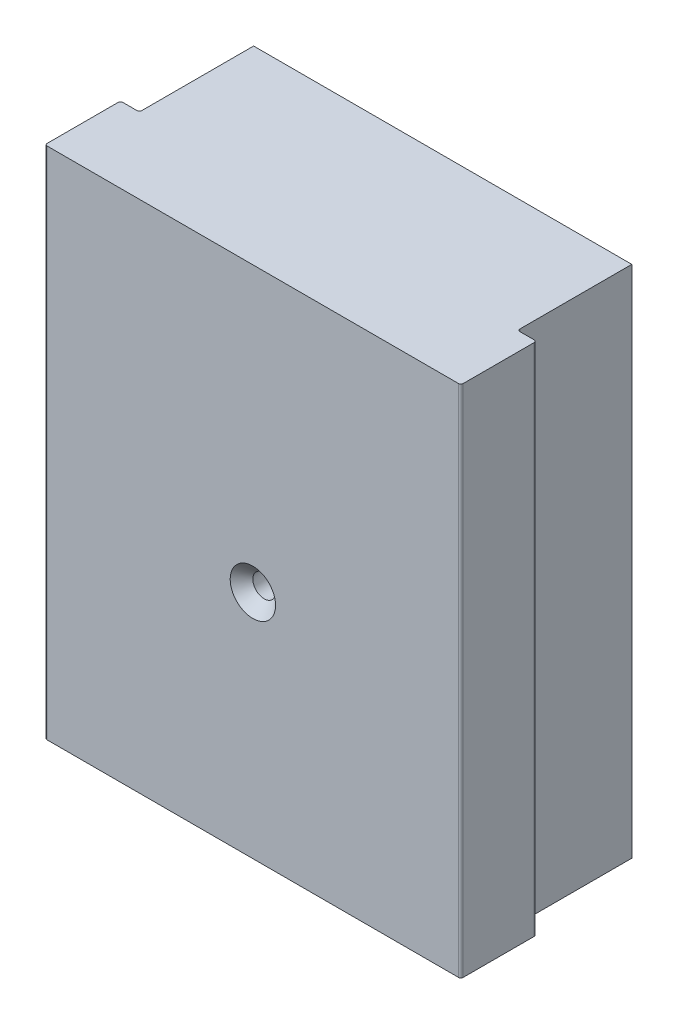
ISO-10303-21;
HEADER;
FILE_DESCRIPTION(('STEP AP214'),'2;1');
FILE_NAME('part.step','',(''),(''),'','','');
FILE_SCHEMA(('AUTOMOTIVE_DESIGN { 1 0 10303 214 1 1 1 1 }'));
ENDSEC;
DATA;
#1=APPLICATION_CONTEXT('core data for automotive mechanical design processes');
#2=APPLICATION_PROTOCOL_DEFINITION('international standard','automotive_design',2000,#1);
#3=PRODUCT_CONTEXT('',#1,'mechanical');
#4=PRODUCT('Part','Part','',(#3));
#5=PRODUCT_RELATED_PRODUCT_CATEGORY('part','',(#4));
#6=PRODUCT_DEFINITION_FORMATION('','',#4);
#7=PRODUCT_DEFINITION_CONTEXT('part definition',#1,'design');
#8=PRODUCT_DEFINITION('design','',#6,#7);
#9=PRODUCT_DEFINITION_SHAPE('','',#8);
#10=(LENGTH_UNIT() NAMED_UNIT(*) SI_UNIT(.MILLI.,.METRE.));
#11=(NAMED_UNIT(*) PLANE_ANGLE_UNIT() SI_UNIT($,.RADIAN.));
#12=(NAMED_UNIT(*) SI_UNIT($,.STERADIAN.) SOLID_ANGLE_UNIT());
#13=UNCERTAINTY_MEASURE_WITH_UNIT(LENGTH_MEASURE(1.E-05),#10,'distance_accuracy_value','');
#14=(GEOMETRIC_REPRESENTATION_CONTEXT(3) GLOBAL_UNCERTAINTY_ASSIGNED_CONTEXT((#13)) GLOBAL_UNIT_ASSIGNED_CONTEXT((#10,
#11,#12)) REPRESENTATION_CONTEXT('',''));
#15=CARTESIAN_POINT('',(0.,0.,0.));
#16=DIRECTION('',(0.,0.,1.));
#17=DIRECTION('',(1.,0.,0.));
#18=AXIS2_PLACEMENT_3D('',#15,#16,#17);
#19=CARTESIAN_POINT('',(27.5,68.,-10.));
#20=DIRECTION('',(-1.,0.,0.));
#21=DIRECTION('',(0.,0.,1.));
#22=AXIS2_PLACEMENT_3D('',#19,#20,#21);
#23=PLANE('',#22);
#24=DIRECTION('',(0.,0.,-1.));
#25=VECTOR('',#24,1.);
#26=CARTESIAN_POINT('',(27.5,68.,-10.));
#27=LINE('',#26,#25);
#28=CARTESIAN_POINT('',(27.5,68.,-0.3));
#29=VERTEX_POINT('',#28);
#30=CARTESIAN_POINT('',(27.5,68.,-9.7));
#31=VERTEX_POINT('',#30);
#32=EDGE_CURVE('E195',#29,#31,#27,.T.);
#33=ORIENTED_EDGE('',*,*,#32,.F.);
#34=DIRECTION('',(0.,-1.,0.));
#35=VECTOR('',#34,1.);
#36=CARTESIAN_POINT('',(27.5,68.,-0.3));
#37=LINE('',#36,#35);
#38=CARTESIAN_POINT('',(27.5,0.,-0.3));
#39=VERTEX_POINT('',#38);
#40=EDGE_CURVE('E230',#29,#39,#37,.T.);
#41=ORIENTED_EDGE('',*,*,#40,.T.);
#42=DIRECTION('',(0.,0.,-1.));
#43=VECTOR('',#42,1.);
#44=CARTESIAN_POINT('',(27.5,0.,-10.));
#45=LINE('',#44,#43);
#46=CARTESIAN_POINT('',(27.5,0.,-9.7));
#47=VERTEX_POINT('',#46);
#48=EDGE_CURVE('E174',#39,#47,#45,.T.);
#49=ORIENTED_EDGE('',*,*,#48,.T.);
#50=DIRECTION('',(0.,-1.,0.));
#51=VECTOR('',#50,1.);
#52=CARTESIAN_POINT('',(27.5,68.,-9.7));
#53=LINE('',#52,#51);
#54=EDGE_CURVE('E228',#47,#31,#53,.F.);
#55=ORIENTED_EDGE('',*,*,#54,.T.);
#56=EDGE_LOOP('',(#33,#41,#49,#55));
#57=FACE_BOUND('',#56,.T.);
#58=ADVANCED_FACE('F34',(#57),#23,.F.);
#59=CARTESIAN_POINT('',(27.5,68.,-10.));
#60=DIRECTION('',(0.,0.,1.));
#61=DIRECTION('',(1.,0.,0.));
#62=AXIS2_PLACEMENT_3D('',#59,#60,#61);
#63=PLANE('',#62);
#64=DIRECTION('',(-1.,0.,0.));
#65=VECTOR('',#64,1.);
#66=CARTESIAN_POINT('',(27.5,68.,-10.));
#67=LINE('',#66,#65);
#68=CARTESIAN_POINT('',(27.2,68.,-10.));
#69=VERTEX_POINT('',#68);
#70=CARTESIAN_POINT('',(25.3,68.,-10.));
#71=VERTEX_POINT('',#70);
#72=EDGE_CURVE('E147',#69,#71,#67,.T.);
#73=ORIENTED_EDGE('',*,*,#72,.F.);
#74=DIRECTION('',(0.,-1.,0.));
#75=VECTOR('',#74,1.);
#76=CARTESIAN_POINT('',(27.2,68.,-10.));
#77=LINE('',#76,#75);
#78=CARTESIAN_POINT('',(27.2,0.,-10.));
#79=VERTEX_POINT('',#78);
#80=EDGE_CURVE('E235',#69,#79,#77,.T.);
#81=ORIENTED_EDGE('',*,*,#80,.T.);
#82=DIRECTION('',(-1.,0.,0.));
#83=VECTOR('',#82,1.);
#84=CARTESIAN_POINT('',(27.5,0.,-10.));
#85=LINE('',#84,#83);
#86=CARTESIAN_POINT('',(25.3,0.,-10.));
#87=VERTEX_POINT('',#86);
#88=EDGE_CURVE('E177',#79,#87,#85,.T.);
#89=ORIENTED_EDGE('',*,*,#88,.T.);
#90=DIRECTION('',(0.,-1.,0.));
#91=VECTOR('',#90,1.);
#92=CARTESIAN_POINT('',(25.3,68.,-10.));
#93=LINE('',#92,#91);
#94=EDGE_CURVE('E233',#87,#71,#93,.F.);
#95=ORIENTED_EDGE('',*,*,#94,.T.);
#96=EDGE_LOOP('',(#73,#81,#89,#95));
#97=FACE_BOUND('',#96,.T.);
#98=ADVANCED_FACE('F251',(#97),#63,.F.);
#99=CARTESIAN_POINT('',(25.,68.,-25.1));
#100=DIRECTION('',(-1.,0.,0.));
#101=DIRECTION('',(0.,0.,1.));
#102=AXIS2_PLACEMENT_3D('',#99,#100,#101);
#103=PLANE('',#102);
#104=DIRECTION('',(0.,0.,-1.));
#105=VECTOR('',#104,1.);
#106=CARTESIAN_POINT('',(25.,68.,-25.1));
#107=LINE('',#106,#105);
#108=CARTESIAN_POINT('',(25.,68.,-10.3));
#109=VERTEX_POINT('',#108);
#110=CARTESIAN_POINT('',(25.,68.,-25.1));
#111=VERTEX_POINT('',#110);
#112=EDGE_CURVE('E135',#109,#111,#107,.T.);
#113=ORIENTED_EDGE('',*,*,#112,.F.);
#114=DIRECTION('',(0.,-1.,0.));
#115=VECTOR('',#114,1.);
#116=CARTESIAN_POINT('',(25.,0.,-10.3));
#117=LINE('',#116,#115);
#118=CARTESIAN_POINT('',(25.,0.,-10.3));
#119=VERTEX_POINT('',#118);
#120=EDGE_CURVE('E238',#109,#119,#117,.T.);
#121=ORIENTED_EDGE('',*,*,#120,.T.);
#122=DIRECTION('',(0.,0.,-1.));
#123=VECTOR('',#122,1.);
#124=CARTESIAN_POINT('',(25.,0.,-25.1));
#125=LINE('',#124,#123);
#126=CARTESIAN_POINT('',(25.,0.,-25.1));
#127=VERTEX_POINT('',#126);
#128=EDGE_CURVE('E153',#119,#127,#125,.T.);
#129=ORIENTED_EDGE('',*,*,#128,.T.);
#130=DIRECTION('',(0.,-1.,0.));
#131=VECTOR('',#130,1.);
#132=CARTESIAN_POINT('',(25.,68.,-25.1));
#133=LINE('',#132,#131);
#134=EDGE_CURVE('E150',#111,#127,#133,.T.);
#135=ORIENTED_EDGE('',*,*,#134,.F.);
#136=EDGE_LOOP('',(#113,#121,#129,#135));
#137=FACE_BOUND('',#136,.T.);
#138=ADVANCED_FACE('F151',(#137),#103,.F.);
#139=CARTESIAN_POINT('',(-25.,68.,-25.1));
#140=DIRECTION('',(0.,0.,1.));
#141=DIRECTION('',(1.,0.,0.));
#142=AXIS2_PLACEMENT_3D('',#139,#140,#141);
#143=PLANE('',#142);
#144=CARTESIAN_POINT('',(0.,30.5,-25.1));
#145=DIRECTION('',(0.,0.,1.));
#146=DIRECTION('',(1.,0.,0.));
#147=AXIS2_PLACEMENT_3D('',#144,#145,#146);
#148=CIRCLE('',#147,2.32413016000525);
#149=CARTESIAN_POINT('',(2.32413016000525,30.5,-25.1));
#150=VERTEX_POINT('',#149);
#151=EDGE_CURVE('E178',#150,#150,#148,.T.);
#152=ORIENTED_EDGE('',*,*,#151,.T.);
#153=EDGE_LOOP('',(#152));
#154=FACE_BOUND('',#153,.T.);
#155=DIRECTION('',(-1.,0.,0.));
#156=VECTOR('',#155,1.);
#157=CARTESIAN_POINT('',(-25.,0.,-25.1));
#158=LINE('',#157,#156);
#159=CARTESIAN_POINT('',(-25.,0.,-25.1));
#160=VERTEX_POINT('',#159);
#161=EDGE_CURVE('E182',#127,#160,#158,.T.);
#162=ORIENTED_EDGE('',*,*,#161,.T.);
#163=DIRECTION('',(0.,-1.,0.));
#164=VECTOR('',#163,1.);
#165=CARTESIAN_POINT('',(-25.,68.,-25.1));
#166=LINE('',#165,#164);
#167=CARTESIAN_POINT('',(-25.,68.,-25.1));
#168=VERTEX_POINT('',#167);
#169=EDGE_CURVE('E157',#168,#160,#166,.T.);
#170=ORIENTED_EDGE('',*,*,#169,.F.);
#171=DIRECTION('',(-1.,0.,0.));
#172=VECTOR('',#171,1.);
#173=CARTESIAN_POINT('',(-25.,68.,-25.1));
#174=LINE('',#173,#172);
#175=EDGE_CURVE('E140',#111,#168,#174,.T.);
#176=ORIENTED_EDGE('',*,*,#175,.F.);
#177=ORIENTED_EDGE('',*,*,#134,.T.);
#178=EDGE_LOOP('',(#162,#170,#176,#177));
#179=FACE_BOUND('',#178,.T.);
#180=ADVANCED_FACE('F159',(#154,#179),#143,.F.);
#181=CARTESIAN_POINT('',(-25.,68.,-25.1));
#182=DIRECTION('',(1.,0.,0.));
#183=DIRECTION('',(0.,0.,-1.));
#184=AXIS2_PLACEMENT_3D('',#181,#182,#183);
#185=PLANE('',#184);
#186=DIRECTION('',(0.,0.,1.));
#187=VECTOR('',#186,1.);
#188=CARTESIAN_POINT('',(-25.,0.,-25.1));
#189=LINE('',#188,#187);
#190=CARTESIAN_POINT('',(-25.,0.,-10.3));
#191=VERTEX_POINT('',#190);
#192=EDGE_CURVE('E184',#160,#191,#189,.T.);
#193=ORIENTED_EDGE('',*,*,#192,.T.);
#194=DIRECTION('',(0.,-1.,0.));
#195=VECTOR('',#194,1.);
#196=CARTESIAN_POINT('',(-25.,68.,-10.3));
#197=LINE('',#196,#195);
#198=CARTESIAN_POINT('',(-25.,68.,-10.3));
#199=VERTEX_POINT('',#198);
#200=EDGE_CURVE('E226',#191,#199,#197,.F.);
#201=ORIENTED_EDGE('',*,*,#200,.T.);
#202=DIRECTION('',(0.,0.,1.));
#203=VECTOR('',#202,1.);
#204=CARTESIAN_POINT('',(-25.,68.,-25.1));
#205=LINE('',#204,#203);
#206=EDGE_CURVE('E162',#168,#199,#205,.T.);
#207=ORIENTED_EDGE('',*,*,#206,.F.);
#208=ORIENTED_EDGE('',*,*,#169,.T.);
#209=EDGE_LOOP('',(#193,#201,#207,#208));
#210=FACE_BOUND('',#209,.T.);
#211=ADVANCED_FACE('F331',(#210),#185,.F.);
#212=CARTESIAN_POINT('',(-27.5,68.,-10.));
#213=DIRECTION('',(0.,0.,1.));
#214=DIRECTION('',(1.,0.,0.));
#215=AXIS2_PLACEMENT_3D('',#212,#213,#214);
#216=PLANE('',#215);
#217=DIRECTION('',(-1.,0.,0.));
#218=VECTOR('',#217,1.);
#219=CARTESIAN_POINT('',(-27.5,0.,-10.));
#220=LINE('',#219,#218);
#221=CARTESIAN_POINT('',(-25.3,0.,-10.));
#222=VERTEX_POINT('',#221);
#223=CARTESIAN_POINT('',(-27.2,0.,-10.));
#224=VERTEX_POINT('',#223);
#225=EDGE_CURVE('E187',#222,#224,#220,.T.);
#226=ORIENTED_EDGE('',*,*,#225,.T.);
#227=DIRECTION('',(0.,-1.,0.));
#228=VECTOR('',#227,1.);
#229=CARTESIAN_POINT('',(-27.2,68.,-10.));
#230=LINE('',#229,#228);
#231=CARTESIAN_POINT('',(-27.2,68.,-10.));
#232=VERTEX_POINT('',#231);
#233=EDGE_CURVE('E50',#224,#232,#230,.F.);
#234=ORIENTED_EDGE('',*,*,#233,.T.);
#235=DIRECTION('',(-1.,0.,0.));
#236=VECTOR('',#235,1.);
#237=CARTESIAN_POINT('',(-27.5,68.,-10.));
#238=LINE('',#237,#236);
#239=CARTESIAN_POINT('',(-25.3,68.,-10.));
#240=VERTEX_POINT('',#239);
#241=EDGE_CURVE('E164',#240,#232,#238,.T.);
#242=ORIENTED_EDGE('',*,*,#241,.F.);
#243=DIRECTION('',(0.,-1.,0.));
#244=VECTOR('',#243,1.);
#245=CARTESIAN_POINT('',(-25.3,0.,-10.));
#246=LINE('',#245,#244);
#247=EDGE_CURVE('E222',#240,#222,#246,.T.);
#248=ORIENTED_EDGE('',*,*,#247,.T.);
#249=EDGE_LOOP('',(#226,#234,#242,#248));
#250=FACE_BOUND('',#249,.T.);
#251=ADVANCED_FACE('F327',(#250),#216,.F.);
#252=CARTESIAN_POINT('',(-27.5,68.,-10.));
#253=DIRECTION('',(1.,0.,0.));
#254=DIRECTION('',(0.,0.,-1.));
#255=AXIS2_PLACEMENT_3D('',#252,#253,#254);
#256=PLANE('',#255);
#257=DIRECTION('',(0.,0.,1.));
#258=VECTOR('',#257,1.);
#259=CARTESIAN_POINT('',(-27.5,0.,-10.));
#260=LINE('',#259,#258);
#261=CARTESIAN_POINT('',(-27.5,0.,-9.7));
#262=VERTEX_POINT('',#261);
#263=CARTESIAN_POINT('',(-27.5,0.,-0.3));
#264=VERTEX_POINT('',#263);
#265=EDGE_CURVE('E189',#262,#264,#260,.T.);
#266=ORIENTED_EDGE('',*,*,#265,.T.);
#267=DIRECTION('',(0.,-1.,0.));
#268=VECTOR('',#267,1.);
#269=CARTESIAN_POINT('',(-27.5,68.,-0.3));
#270=LINE('',#269,#268);
#271=CARTESIAN_POINT('',(-27.5,68.,-0.3));
#272=VERTEX_POINT('',#271);
#273=EDGE_CURVE('E212',#264,#272,#270,.F.);
#274=ORIENTED_EDGE('',*,*,#273,.T.);
#275=DIRECTION('',(0.,0.,1.));
#276=VECTOR('',#275,1.);
#277=CARTESIAN_POINT('',(-27.5,68.,-10.));
#278=LINE('',#277,#276);
#279=CARTESIAN_POINT('',(-27.5,68.,-9.7));
#280=VERTEX_POINT('',#279);
#281=EDGE_CURVE('E169',#280,#272,#278,.T.);
#282=ORIENTED_EDGE('',*,*,#281,.F.);
#283=DIRECTION('',(0.,-1.,0.));
#284=VECTOR('',#283,1.);
#285=CARTESIAN_POINT('',(-27.5,68.,-9.7));
#286=LINE('',#285,#284);
#287=EDGE_CURVE('E209',#280,#262,#286,.T.);
#288=ORIENTED_EDGE('',*,*,#287,.T.);
#289=EDGE_LOOP('',(#266,#274,#282,#288));
#290=FACE_BOUND('',#289,.T.);
#291=ADVANCED_FACE('F324',(#290),#256,.F.);
#292=CARTESIAN_POINT('',(-27.5,68.,0.));
#293=DIRECTION('',(0.,0.,-1.));
#294=DIRECTION('',(-1.,0.,0.));
#295=AXIS2_PLACEMENT_3D('',#292,#293,#294);
#296=PLANE('',#295);
#297=CARTESIAN_POINT('',(0.,30.5,0.));
#298=DIRECTION('',(0.,0.,-1.));
#299=DIRECTION('',(-1.,0.,0.));
#300=AXIS2_PLACEMENT_3D('',#297,#298,#299);
#301=CIRCLE('',#300,3.00000000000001);
#302=CARTESIAN_POINT('',(-3.00000000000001,30.5,0.));
#303=VERTEX_POINT('',#302);
#304=EDGE_CURVE('E38',#303,#303,#301,.T.);
#305=ORIENTED_EDGE('',*,*,#304,.T.);
#306=EDGE_LOOP('',(#305));
#307=FACE_BOUND('',#306,.T.);
#308=DIRECTION('',(1.,0.,0.));
#309=VECTOR('',#308,1.);
#310=CARTESIAN_POINT('',(-27.5,68.,0.));
#311=LINE('',#310,#309);
#312=CARTESIAN_POINT('',(-27.2,68.,0.));
#313=VERTEX_POINT('',#312);
#314=CARTESIAN_POINT('',(27.2,68.,0.));
#315=VERTEX_POINT('',#314);
#316=EDGE_CURVE('E171',#313,#315,#311,.T.);
#317=ORIENTED_EDGE('',*,*,#316,.F.);
#318=DIRECTION('',(0.,-1.,0.));
#319=VECTOR('',#318,1.);
#320=CARTESIAN_POINT('',(-27.2,68.,0.));
#321=LINE('',#320,#319);
#322=CARTESIAN_POINT('',(-27.2,0.,0.));
#323=VERTEX_POINT('',#322);
#324=EDGE_CURVE('E198',#313,#323,#321,.T.);
#325=ORIENTED_EDGE('',*,*,#324,.T.);
#326=DIRECTION('',(1.,0.,0.));
#327=VECTOR('',#326,1.);
#328=CARTESIAN_POINT('',(-27.5,0.,0.));
#329=LINE('',#328,#327);
#330=CARTESIAN_POINT('',(27.2,0.,0.));
#331=VERTEX_POINT('',#330);
#332=EDGE_CURVE('E192',#323,#331,#329,.T.);
#333=ORIENTED_EDGE('',*,*,#332,.T.);
#334=DIRECTION('',(0.,-1.,0.));
#335=VECTOR('',#334,1.);
#336=CARTESIAN_POINT('',(27.2,68.,0.));
#337=LINE('',#336,#335);
#338=EDGE_CURVE('E156',#331,#315,#337,.F.);
#339=ORIENTED_EDGE('',*,*,#338,.T.);
#340=EDGE_LOOP('',(#317,#325,#333,#339));
#341=FACE_BOUND('',#340,.T.);
#342=ADVANCED_FACE('F310',(#307,#341),#296,.F.);
#343=CARTESIAN_POINT('',(0.,68.,0.));
#344=DIRECTION('',(0.,1.,0.));
#345=DIRECTION('',(0.,0.,1.));
#346=AXIS2_PLACEMENT_3D('',#343,#344,#345);
#347=PLANE('',#346);
#348=ORIENTED_EDGE('',*,*,#281,.T.);
#349=CARTESIAN_POINT('',(-27.2,68.,-0.3));
#350=DIRECTION('',(0.,1.,0.));
#351=DIRECTION('',(0.,0.,1.));
#352=AXIS2_PLACEMENT_3D('',#349,#350,#351);
#353=CIRCLE('',#352,0.3);
#354=EDGE_CURVE('E220',#272,#313,#353,.T.);
#355=ORIENTED_EDGE('',*,*,#354,.T.);
#356=ORIENTED_EDGE('',*,*,#316,.T.);
#357=CARTESIAN_POINT('',(27.2,68.,-0.3));
#358=DIRECTION('',(0.,1.,0.));
#359=DIRECTION('',(0.,0.,1.));
#360=AXIS2_PLACEMENT_3D('',#357,#358,#359);
#361=CIRCLE('',#360,0.3);
#362=EDGE_CURVE('E216',#315,#29,#361,.T.);
#363=ORIENTED_EDGE('',*,*,#362,.T.);
#364=ORIENTED_EDGE('',*,*,#32,.T.);
#365=CARTESIAN_POINT('',(27.2,68.,-9.7));
#366=DIRECTION('',(0.,1.,0.));
#367=DIRECTION('',(0.,0.,1.));
#368=AXIS2_PLACEMENT_3D('',#365,#366,#367);
#369=CIRCLE('',#368,0.3);
#370=EDGE_CURVE('E214',#31,#69,#369,.T.);
#371=ORIENTED_EDGE('',*,*,#370,.T.);
#372=ORIENTED_EDGE('',*,*,#72,.T.);
#373=CARTESIAN_POINT('',(25.3,68.,-10.3));
#374=DIRECTION('',(0.,1.,0.));
#375=DIRECTION('',(0.,0.,1.));
#376=AXIS2_PLACEMENT_3D('',#373,#374,#375);
#377=CIRCLE('',#376,0.3);
#378=EDGE_CURVE('E11',#71,#109,#377,.F.);
#379=ORIENTED_EDGE('',*,*,#378,.T.);
#380=ORIENTED_EDGE('',*,*,#112,.T.);
#381=ORIENTED_EDGE('',*,*,#175,.T.);
#382=ORIENTED_EDGE('',*,*,#206,.T.);
#383=CARTESIAN_POINT('',(-25.3,68.,-10.3));
#384=DIRECTION('',(0.,1.,0.));
#385=DIRECTION('',(0.,0.,1.));
#386=AXIS2_PLACEMENT_3D('',#383,#384,#385);
#387=CIRCLE('',#386,0.3);
#388=EDGE_CURVE('E57',#199,#240,#387,.F.);
#389=ORIENTED_EDGE('',*,*,#388,.T.);
#390=ORIENTED_EDGE('',*,*,#241,.T.);
#391=CARTESIAN_POINT('',(-27.2,68.,-9.7));
#392=DIRECTION('',(0.,1.,0.));
#393=DIRECTION('',(0.,0.,1.));
#394=AXIS2_PLACEMENT_3D('',#391,#392,#393);
#395=CIRCLE('',#394,0.3);
#396=EDGE_CURVE('E218',#232,#280,#395,.T.);
#397=ORIENTED_EDGE('',*,*,#396,.T.);
#398=EDGE_LOOP('',(#348,#355,#356,#363,#364,#371,#372,#379,#380,#381,#382,#389,#390,#397));
#399=FACE_BOUND('',#398,.T.);
#400=ADVANCED_FACE('F138',(#399),#347,.T.);
#401=CARTESIAN_POINT('',(0.,0.,0.));
#402=DIRECTION('',(0.,1.,0.));
#403=DIRECTION('',(0.,0.,1.));
#404=AXIS2_PLACEMENT_3D('',#401,#402,#403);
#405=PLANE('',#404);
#406=ORIENTED_EDGE('',*,*,#332,.F.);
#407=CARTESIAN_POINT('',(-27.2,0.,-0.3));
#408=DIRECTION('',(0.,1.,0.));
#409=DIRECTION('',(0.,0.,1.));
#410=AXIS2_PLACEMENT_3D('',#407,#408,#409);
#411=CIRCLE('',#410,0.3);
#412=EDGE_CURVE('E207',#323,#264,#411,.F.);
#413=ORIENTED_EDGE('',*,*,#412,.T.);
#414=ORIENTED_EDGE('',*,*,#265,.F.);
#415=CARTESIAN_POINT('',(-27.2,0.,-9.7));
#416=DIRECTION('',(0.,1.,0.));
#417=DIRECTION('',(0.,0.,1.));
#418=AXIS2_PLACEMENT_3D('',#415,#416,#417);
#419=CIRCLE('',#418,0.3);
#420=EDGE_CURVE('E205',#262,#224,#419,.F.);
#421=ORIENTED_EDGE('',*,*,#420,.T.);
#422=ORIENTED_EDGE('',*,*,#225,.F.);
#423=CARTESIAN_POINT('',(-25.3,0.,-10.3));
#424=DIRECTION('',(0.,1.,0.));
#425=DIRECTION('',(0.,0.,1.));
#426=AXIS2_PLACEMENT_3D('',#423,#424,#425);
#427=CIRCLE('',#426,0.3);
#428=EDGE_CURVE('E240',#222,#191,#427,.T.);
#429=ORIENTED_EDGE('',*,*,#428,.T.);
#430=ORIENTED_EDGE('',*,*,#192,.F.);
#431=ORIENTED_EDGE('',*,*,#161,.F.);
#432=ORIENTED_EDGE('',*,*,#128,.F.);
#433=CARTESIAN_POINT('',(25.3,0.,-10.3));
#434=DIRECTION('',(0.,1.,0.));
#435=DIRECTION('',(0.,0.,1.));
#436=AXIS2_PLACEMENT_3D('',#433,#434,#435);
#437=CIRCLE('',#436,0.3);
#438=EDGE_CURVE('E43',#119,#87,#437,.T.);
#439=ORIENTED_EDGE('',*,*,#438,.T.);
#440=ORIENTED_EDGE('',*,*,#88,.F.);
#441=CARTESIAN_POINT('',(27.2,0.,-9.7));
#442=DIRECTION('',(0.,1.,0.));
#443=DIRECTION('',(0.,0.,1.));
#444=AXIS2_PLACEMENT_3D('',#441,#442,#443);
#445=CIRCLE('',#444,0.3);
#446=EDGE_CURVE('E201',#79,#47,#445,.F.);
#447=ORIENTED_EDGE('',*,*,#446,.T.);
#448=ORIENTED_EDGE('',*,*,#48,.F.);
#449=CARTESIAN_POINT('',(27.2,0.,-0.3));
#450=DIRECTION('',(0.,1.,0.));
#451=DIRECTION('',(0.,0.,1.));
#452=AXIS2_PLACEMENT_3D('',#449,#450,#451);
#453=CIRCLE('',#452,0.3);
#454=EDGE_CURVE('E203',#39,#331,#453,.F.);
#455=ORIENTED_EDGE('',*,*,#454,.T.);
#456=EDGE_LOOP('',(#406,#413,#414,#421,#422,#429,#430,#431,#432,#439,#440,#447,#448,#455));
#457=FACE_BOUND('',#456,.T.);
#458=ADVANCED_FACE('F246',(#457),#405,.F.);
#459=CARTESIAN_POINT('',(-27.2,68.,-0.3));
#460=DIRECTION('',(0.,-1.,0.));
#461=DIRECTION('',(0.,0.,-1.));
#462=AXIS2_PLACEMENT_3D('',#459,#460,#461);
#463=CYLINDRICAL_SURFACE('',#462,0.3);
#464=ORIENTED_EDGE('',*,*,#354,.F.);
#465=ORIENTED_EDGE('',*,*,#273,.F.);
#466=ORIENTED_EDGE('',*,*,#412,.F.);
#467=ORIENTED_EDGE('',*,*,#324,.F.);
#468=EDGE_LOOP('',(#464,#465,#466,#467));
#469=FACE_BOUND('',#468,.T.);
#470=ADVANCED_FACE('F275',(#469),#463,.T.);
#471=CARTESIAN_POINT('',(-27.2,68.,-9.7));
#472=DIRECTION('',(0.,-1.,0.));
#473=DIRECTION('',(0.,0.,-1.));
#474=AXIS2_PLACEMENT_3D('',#471,#472,#473);
#475=CYLINDRICAL_SURFACE('',#474,0.3);
#476=ORIENTED_EDGE('',*,*,#396,.F.);
#477=ORIENTED_EDGE('',*,*,#233,.F.);
#478=ORIENTED_EDGE('',*,*,#420,.F.);
#479=ORIENTED_EDGE('',*,*,#287,.F.);
#480=EDGE_LOOP('',(#476,#477,#478,#479));
#481=FACE_BOUND('',#480,.T.);
#482=ADVANCED_FACE('F278',(#481),#475,.T.);
#483=CARTESIAN_POINT('',(-25.3,68.,-10.3));
#484=DIRECTION('',(0.,1.,0.));
#485=DIRECTION('',(0.,0.,1.));
#486=AXIS2_PLACEMENT_3D('',#483,#484,#485);
#487=CYLINDRICAL_SURFACE('',#486,0.3);
#488=ORIENTED_EDGE('',*,*,#388,.F.);
#489=ORIENTED_EDGE('',*,*,#200,.F.);
#490=ORIENTED_EDGE('',*,*,#428,.F.);
#491=ORIENTED_EDGE('',*,*,#247,.F.);
#492=EDGE_LOOP('',(#488,#489,#490,#491));
#493=FACE_BOUND('',#492,.T.);
#494=ADVANCED_FACE('F282',(#493),#487,.F.);
#495=CARTESIAN_POINT('',(27.2,68.,-0.3));
#496=DIRECTION('',(0.,-1.,0.));
#497=DIRECTION('',(0.,0.,-1.));
#498=AXIS2_PLACEMENT_3D('',#495,#496,#497);
#499=CYLINDRICAL_SURFACE('',#498,0.3);
#500=ORIENTED_EDGE('',*,*,#362,.F.);
#501=ORIENTED_EDGE('',*,*,#338,.F.);
#502=ORIENTED_EDGE('',*,*,#454,.F.);
#503=ORIENTED_EDGE('',*,*,#40,.F.);
#504=EDGE_LOOP('',(#500,#501,#502,#503));
#505=FACE_BOUND('',#504,.T.);
#506=ADVANCED_FACE('F263',(#505),#499,.T.);
#507=CARTESIAN_POINT('',(27.2,68.,-9.7));
#508=DIRECTION('',(0.,-1.,0.));
#509=DIRECTION('',(0.,0.,-1.));
#510=AXIS2_PLACEMENT_3D('',#507,#508,#509);
#511=CYLINDRICAL_SURFACE('',#510,0.3);
#512=ORIENTED_EDGE('',*,*,#370,.F.);
#513=ORIENTED_EDGE('',*,*,#54,.F.);
#514=ORIENTED_EDGE('',*,*,#446,.F.);
#515=ORIENTED_EDGE('',*,*,#80,.F.);
#516=EDGE_LOOP('',(#512,#513,#514,#515));
#517=FACE_BOUND('',#516,.T.);
#518=ADVANCED_FACE('F255',(#517),#511,.T.);
#519=CARTESIAN_POINT('',(25.3,68.,-10.3));
#520=DIRECTION('',(0.,1.,0.));
#521=DIRECTION('',(0.,0.,1.));
#522=AXIS2_PLACEMENT_3D('',#519,#520,#521);
#523=CYLINDRICAL_SURFACE('',#522,0.3);
#524=ORIENTED_EDGE('',*,*,#378,.F.);
#525=ORIENTED_EDGE('',*,*,#94,.F.);
#526=ORIENTED_EDGE('',*,*,#438,.F.);
#527=ORIENTED_EDGE('',*,*,#120,.F.);
#528=EDGE_LOOP('',(#524,#525,#526,#527));
#529=FACE_BOUND('',#528,.T.);
#530=ADVANCED_FACE('F36',(#529),#523,.F.);
#531=CARTESIAN_POINT('',(0.,30.5,-1.5));
#532=DIRECTION('',(0.,0.,-1.));
#533=DIRECTION('',(1.,0.,0.));
#534=AXIS2_PLACEMENT_3D('',#531,#532,#533);
#535=CONICAL_SURFACE('',#534,1.5,0.0349065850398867);
#536=ORIENTED_EDGE('',*,*,#151,.F.);
#537=EDGE_LOOP('',(#536));
#538=FACE_BOUND('',#537,.T.);
#539=CARTESIAN_POINT('',(0.,30.5,-1.5));
#540=DIRECTION('',(0.,0.,-1.));
#541=DIRECTION('',(-1.,0.,0.));
#542=AXIS2_PLACEMENT_3D('',#539,#540,#541);
#543=CIRCLE('',#542,1.5);
#544=CARTESIAN_POINT('',(-1.5,30.5,-1.5));
#545=VERTEX_POINT('',#544);
#546=EDGE_CURVE('E303',#545,#545,#543,.T.);
#547=ORIENTED_EDGE('',*,*,#546,.F.);
#548=EDGE_LOOP('',(#547));
#549=FACE_BOUND('',#548,.T.);
#550=ADVANCED_FACE('F254',(#538,#549),#535,.F.);
#551=CARTESIAN_POINT('',(0.,30.5,-1.5));
#552=DIRECTION('',(0.,0.,1.));
#553=DIRECTION('',(-1.,0.,0.));
#554=AXIS2_PLACEMENT_3D('',#551,#552,#553);
#555=CONICAL_SURFACE('',#554,1.5,0.78539816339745);
#556=ORIENTED_EDGE('',*,*,#546,.T.);
#557=EDGE_LOOP('',(#556));
#558=FACE_BOUND('',#557,.T.);
#559=ORIENTED_EDGE('',*,*,#304,.F.);
#560=EDGE_LOOP('',(#559));
#561=FACE_BOUND('',#560,.T.);
#562=ADVANCED_FACE('F260',(#558,#561),#555,.F.);
#563=CLOSED_SHELL('',(#58,#98,#138,#180,#211,#251,#291,#342,#400,#458,#470,#482,#494,#506,#518,
#530,#550,#562));
#564=MANIFOLD_SOLID_BREP('B2',#563);
#565=ADVANCED_BREP_SHAPE_REPRESENTATION('',(#18,#564),#14);
#566=SHAPE_DEFINITION_REPRESENTATION(#9,#565);
ENDSEC;
END-ISO-10303-21;
